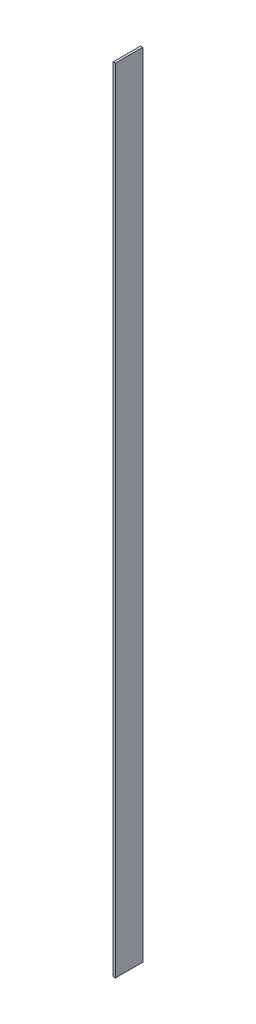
from build123d import *

# Parameters (mm, degrees)
SKETCH1_W           = 1219.2
SKETCH1_H           = 3.175
BOSS_EXTRUDE1_DEPTH = 38.1
F_43_5IN_DEPTH      = 611.791527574
F_43_5IN_DEPTH_BACK = 611.791527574
SKETCH2_W           = 150.754476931
SKETCH2_H           = 226.305101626
SKETCH2_W_2         = 114.492056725
SKETCH2_H_2         = 244.778987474


with BuildPart() as part:
    # Sketch1 → Boss-Extrude1 (new body)
    with BuildSketch(Plane(origin=(0, 0, 0), x_dir=(0, 1, 0), z_dir=(0, 0, 1))):
        Rectangle(SKETCH1_W, SKETCH1_H)
    extrude(amount=BOSS_EXTRUDE1_DEPTH)

    # Sketch2 → 43.5in (cut, two sides: drawn at the far end of the back side and taken through both)
    with BuildSketch(Plane.YZ.offset(-F_43_5IN_DEPTH_BACK)):
        with Locations((-627.827238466, 40.973828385)):
            Rectangle(SKETCH2_W, SKETCH2_H)
        with Locations((609.696028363, 31.736885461)):
            Rectangle(SKETCH2_W_2, SKETCH2_H_2)
    extrude(amount=F_43_5IN_DEPTH + F_43_5IN_DEPTH_BACK, mode=Mode.SUBTRACT)


solid = part.part
